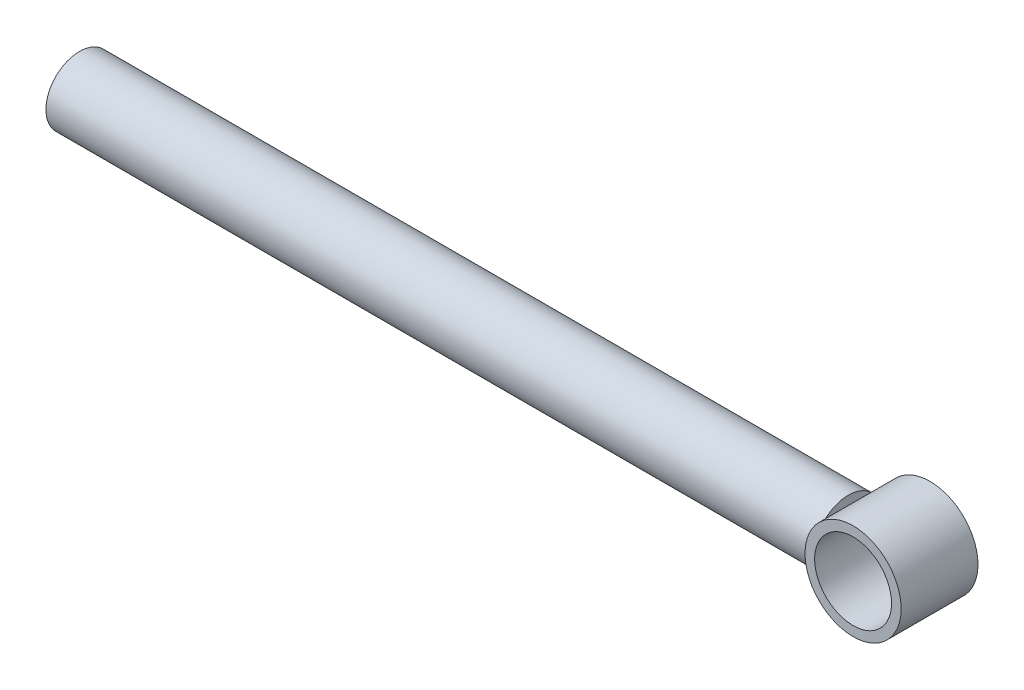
from build123d import *

# Parameters (mm, degrees)
BASE_EXTRUDE_DEPTH      = 50.8
BASE_EXTRUDE_DEPTH_BACK = 50.8
SKETCH1_R               = 63.5
SKETCH1_R_2             = 50.8
SKETCH2_R               = 44.45
BOSS_EXTRUDE2_DEPTH     = 1016


with BuildPart() as part:
    # Sketch1 → Base-Extrude (new, two sides: drawn at the far end of the back side and taken through both)
    with BuildSketch(Plane.XY.offset(-BASE_EXTRUDE_DEPTH_BACK)):
        Circle(SKETCH1_R)
        Circle(SKETCH1_R_2, mode=Mode.SUBTRACT)
    extrude(amount=BASE_EXTRUDE_DEPTH + BASE_EXTRUDE_DEPTH_BACK)

    # Sketch2 → Boss-Extrude2 (add)
    with BuildSketch(Plane(origin=(-57.15, 0, 0), x_dir=(0, 0, -1), z_dir=(1, 0, 0))):
        Circle(SKETCH2_R)
    extrude(amount=-BOSS_EXTRUDE2_DEPTH)


solid = part.part
